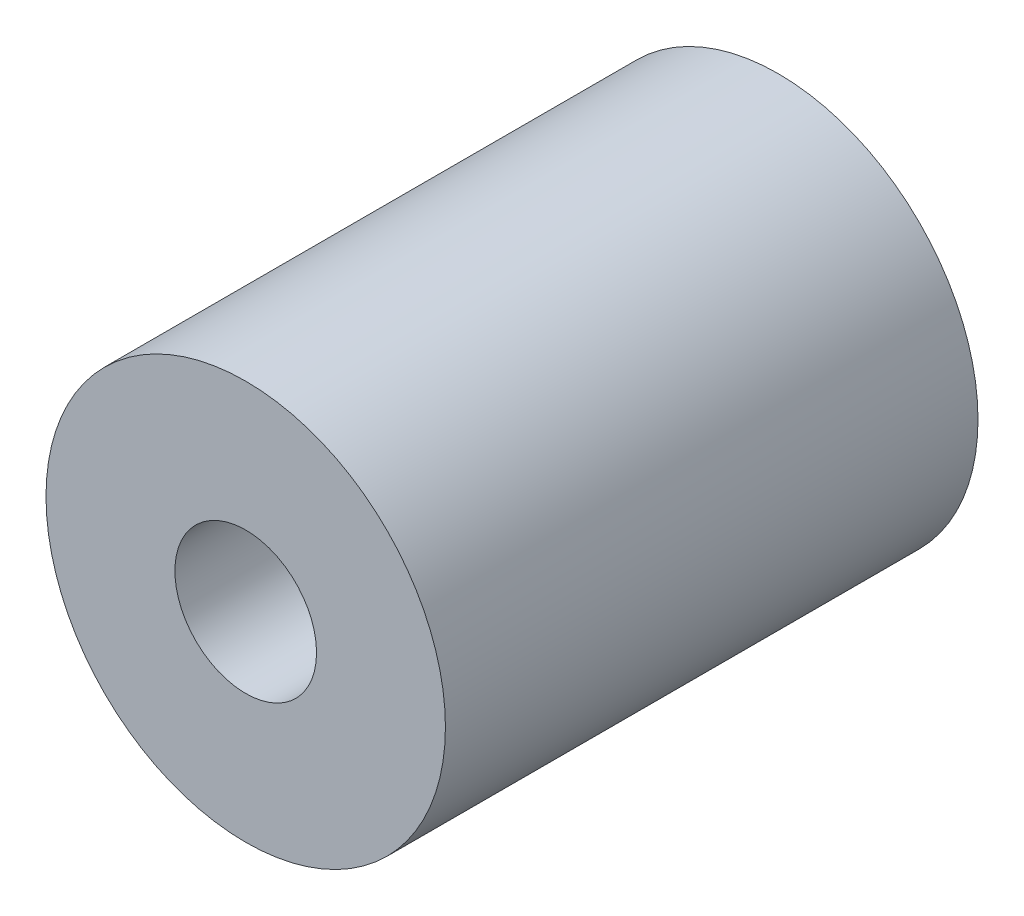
from build123d import *

# Parameters (mm, degrees)
SKETCH1_R           = 9.525
SKETCH1_R_2         = 3.3782
BOSS_EXTRUDE1_DEPTH = 12.7


with BuildPart() as part:
    # Sketch1 → Boss-Extrude1 (new, symmetric)
    with BuildSketch(Plane.XY):
        Circle(SKETCH1_R)
        Circle(SKETCH1_R_2, mode=Mode.SUBTRACT)
    extrude(amount=BOSS_EXTRUDE1_DEPTH, both=True)


solid = part.part
